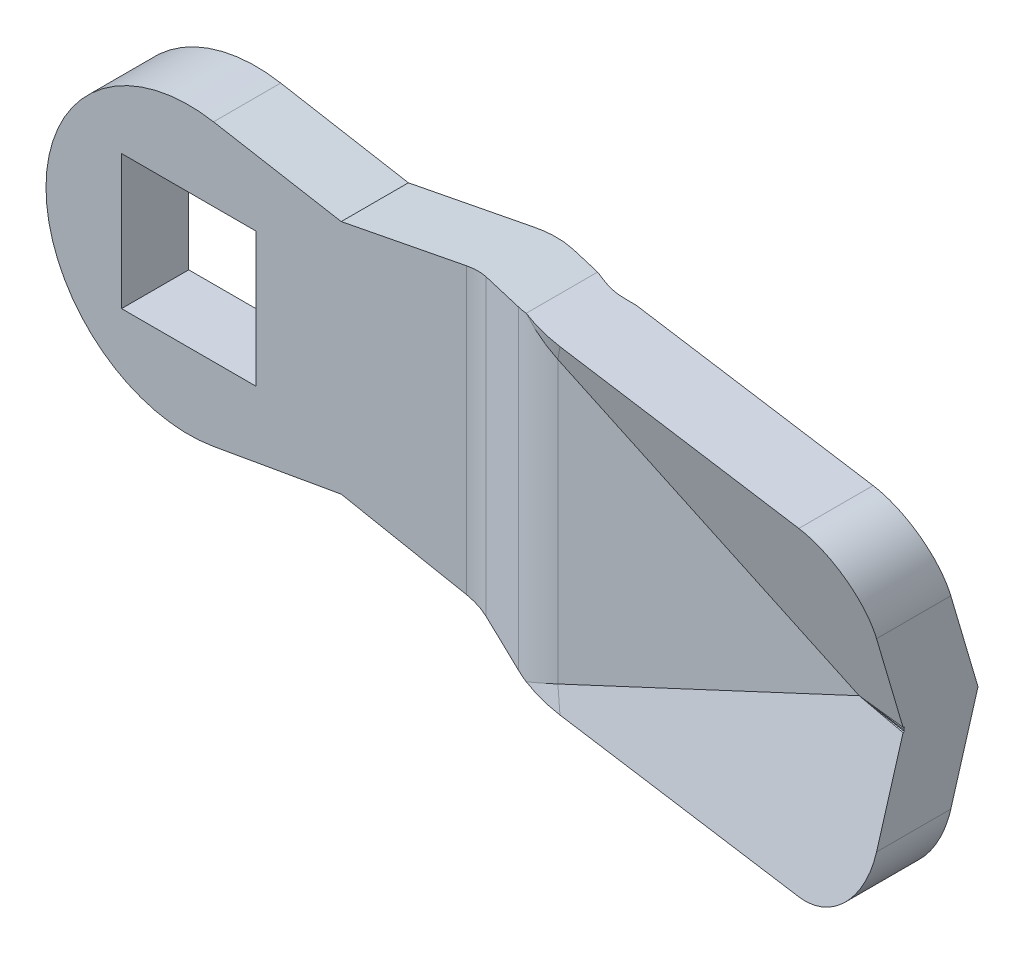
ISO-10303-21;
HEADER;
FILE_DESCRIPTION(('STEP AP214'),'2;1');
FILE_NAME('part.step','',(''),(''),'','','');
FILE_SCHEMA(('AUTOMOTIVE_DESIGN { 1 0 10303 214 1 1 1 1 }'));
ENDSEC;
DATA;
#1=APPLICATION_CONTEXT('core data for automotive mechanical design processes');
#2=APPLICATION_PROTOCOL_DEFINITION('international standard','automotive_design',2000,#1);
#3=PRODUCT_CONTEXT('',#1,'mechanical');
#4=PRODUCT('Part','Part','',(#3));
#5=PRODUCT_RELATED_PRODUCT_CATEGORY('part','',(#4));
#6=PRODUCT_DEFINITION_FORMATION('','',#4);
#7=PRODUCT_DEFINITION_CONTEXT('part definition',#1,'design');
#8=PRODUCT_DEFINITION('design','',#6,#7);
#9=PRODUCT_DEFINITION_SHAPE('','',#8);
#10=(LENGTH_UNIT() NAMED_UNIT(*) SI_UNIT(.MILLI.,.METRE.));
#11=(NAMED_UNIT(*) PLANE_ANGLE_UNIT() SI_UNIT($,.RADIAN.));
#12=(NAMED_UNIT(*) SI_UNIT($,.STERADIAN.) SOLID_ANGLE_UNIT());
#13=UNCERTAINTY_MEASURE_WITH_UNIT(LENGTH_MEASURE(1.E-05),#10,'distance_accuracy_value','');
#14=(GEOMETRIC_REPRESENTATION_CONTEXT(3) GLOBAL_UNCERTAINTY_ASSIGNED_CONTEXT((#13)) GLOBAL_UNIT_ASSIGNED_CONTEXT((#10,
#11,#12)) REPRESENTATION_CONTEXT('',''));
#15=CARTESIAN_POINT('',(0.,0.,0.));
#16=DIRECTION('',(0.,0.,1.));
#17=DIRECTION('',(1.,0.,0.));
#18=AXIS2_PLACEMENT_3D('',#15,#16,#17);
#19=CARTESIAN_POINT('',(68.0503983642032,-56.0267452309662,26.0861046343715));
#20=DIRECTION('',(0.130596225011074,-0.280064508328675,-0.951056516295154));
#21=DIRECTION('',(0.,-0.959272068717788,0.282483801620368));
#22=AXIS2_PLACEMENT_3D('',#19,#20,#21);
#23=PLANE('',#22);
#24=DIRECTION('',(-0.990703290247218,0.,-0.136040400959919));
#25=VECTOR('',#24,1.);
#26=CARTESIAN_POINT('',(69.8969690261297,-9.5,12.6386021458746));
#27=LINE('',#26,#25);
#28=CARTESIAN_POINT('',(41.,-9.5,8.6705571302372));
#29=VERTEX_POINT('',#28);
#30=CARTESIAN_POINT('',(24.5112789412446,-9.5,6.40637546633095));
#31=VERTEX_POINT('',#30);
#32=EDGE_CURVE('E494',#29,#31,#27,.T.);
#33=ORIENTED_EDGE('',*,*,#32,.F.);
#34=CARTESIAN_POINT('',(41.,-5.5,7.49264812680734));
#35=DIRECTION('',(0.130596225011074,-0.280064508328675,-0.951056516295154));
#36=DIRECTION('',(0.401933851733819,-0.861949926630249,0.309016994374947));
#37=AXIS2_PLACEMENT_3D('',#34,#35,#36);
#38=ELLIPSE('',#37,4.20584889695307,4.);
#39=CARTESIAN_POINT('',(45.,-5.5,8.0419161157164));
#40=VERTEX_POINT('',#39);
#41=EDGE_CURVE('E516',#29,#40,#38,.F.);
#42=ORIENTED_EDGE('',*,*,#41,.T.);
#43=DIRECTION('',(0.,0.959272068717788,-0.282483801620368));
#44=VECTOR('',#43,1.);
#45=CARTESIAN_POINT('',(45.,-56.884450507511,23.1734678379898));
#46=LINE('',#45,#44);
#47=CARTESIAN_POINT('',(45.,-0.136162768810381,6.46238807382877));
#48=VERTEX_POINT('',#47);
#49=EDGE_CURVE('E386',#40,#48,#46,.T.);
#50=ORIENTED_EDGE('',*,*,#49,.T.);
#51=DIRECTION('',(0.987938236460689,-0.0437421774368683,0.14854178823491));
#52=VECTOR('',#51,1.);
#53=CARTESIAN_POINT('',(72.7927650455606,-1.36672153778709,10.6411786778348));
#54=LINE('',#53,#52);
#55=CARTESIAN_POINT('',(41.924698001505,0.,6.));
#56=VERTEX_POINT('',#55);
#57=EDGE_CURVE('E231',#56,#48,#54,.T.);
#58=ORIENTED_EDGE('',*,*,#57,.F.);
#59=DIRECTION('',(0.906307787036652,0.422618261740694,0.));
#60=VECTOR('',#59,1.);
#61=CARTESIAN_POINT('',(54.0925461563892,5.67396077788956,6.));
#62=LINE('',#61,#60);
#63=CARTESIAN_POINT('',(23.9827123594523,-8.36648530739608,6.));
#64=VERTEX_POINT('',#63);
#65=EDGE_CURVE('E446',#56,#64,#62,.F.);
#66=ORIENTED_EDGE('',*,*,#65,.T.);
#67=DIRECTION('',(-0.401933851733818,0.861949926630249,-0.309016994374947));
#68=VECTOR('',#67,1.);
#69=CARTESIAN_POINT('',(50.1084127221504,-64.3932305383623,26.0861046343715));
#70=LINE('',#69,#68);
#71=EDGE_CURVE('E433',#31,#64,#70,.T.);
#72=ORIENTED_EDGE('',*,*,#71,.F.);
#73=EDGE_LOOP('',(#33,#42,#50,#58,#66,#72));
#74=FACE_BOUND('',#73,.T.);
#75=ADVANCED_FACE('F14',(#74),#23,.F.);
#76=CARTESIAN_POINT('',(45.,32.7372831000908,-36.));
#77=DIRECTION('',(-1.,0.,0.));
#78=DIRECTION('',(0.,0.,-1.));
#79=AXIS2_PLACEMENT_3D('',#76,#77,#78);
#80=PLANE('',#79);
#81=ORIENTED_EDGE('',*,*,#49,.F.);
#82=DIRECTION('',(0.,0.,-1.));
#83=VECTOR('',#82,1.);
#84=CARTESIAN_POINT('',(45.,-5.5,-36.));
#85=LINE('',#84,#83);
#86=CARTESIAN_POINT('',(45.,-5.5,3.61962487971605));
#87=VERTEX_POINT('',#86);
#88=EDGE_CURVE('E509',#40,#87,#85,.T.);
#89=ORIENTED_EDGE('',*,*,#88,.T.);
#90=DIRECTION('',(0.,-0.959272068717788,0.282483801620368));
#91=VECTOR('',#90,1.);
#92=CARTESIAN_POINT('',(45.,-65.7408100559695,21.3591730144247));
#93=LINE('',#92,#91);
#94=CARTESIAN_POINT('',(45.,0.,2.));
#95=VERTEX_POINT('',#94);
#96=EDGE_CURVE('E390',#95,#87,#93,.T.);
#97=ORIENTED_EDGE('',*,*,#96,.F.);
#98=DIRECTION('',(0.,-0.959272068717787,-0.28248380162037));
#99=VECTOR('',#98,1.);
#100=CARTESIAN_POINT('',(45.,35.0762353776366,12.3291533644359));
#101=LINE('',#100,#99);
#102=CARTESIAN_POINT('',(45.,5.5,3.61962487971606));
#103=VERTEX_POINT('',#102);
#104=EDGE_CURVE('E388',#103,#95,#101,.T.);
#105=ORIENTED_EDGE('',*,*,#104,.F.);
#106=DIRECTION('',(0.,0.,-1.));
#107=VECTOR('',#106,1.);
#108=CARTESIAN_POINT('',(45.,5.5,-36.));
#109=LINE('',#108,#107);
#110=CARTESIAN_POINT('',(45.,5.5,8.04191611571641));
#111=VERTEX_POINT('',#110);
#112=EDGE_CURVE('E507',#103,#111,#109,.F.);
#113=ORIENTED_EDGE('',*,*,#112,.T.);
#114=DIRECTION('',(0.,0.959272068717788,0.282483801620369));
#115=VECTOR('',#114,1.);
#116=CARTESIAN_POINT('',(45.,42.660667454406,18.9848873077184));
#117=LINE('',#116,#115);
#118=CARTESIAN_POINT('',(45.,0.136162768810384,6.46238807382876));
#119=VERTEX_POINT('',#118);
#120=EDGE_CURVE('E384',#119,#111,#117,.T.);
#121=ORIENTED_EDGE('',*,*,#120,.F.);
#122=DIRECTION('',(0.,-0.282483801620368,-0.959272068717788));
#123=VECTOR('',#122,1.);
#124=CARTESIAN_POINT('',(45.,-8.76877027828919,-23.7774115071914));
#125=LINE('',#124,#123);
#126=CARTESIAN_POINT('',(45.,0.114431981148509,6.38859362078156));
#127=VERTEX_POINT('',#126);
#128=EDGE_CURVE('E503',#119,#127,#125,.T.);
#129=ORIENTED_EDGE('',*,*,#128,.T.);
#130=CARTESIAN_POINT('',(45.,0.,6.42229123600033));
#131=VERTEX_POINT('',#130);
#132=EDGE_CURVE('E246',#131,#127,#46,.T.);
#133=ORIENTED_EDGE('',*,*,#132,.F.);
#134=DIRECTION('',(0.,-0.959272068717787,-0.28248380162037));
#135=VECTOR('',#134,1.);
#136=CARTESIAN_POINT('',(45.,18.629400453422,11.9082258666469));
#137=LINE('',#136,#135);
#138=CARTESIAN_POINT('',(45.,-0.114431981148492,6.38859362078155));
#139=VERTEX_POINT('',#138);
#140=EDGE_CURVE('E239',#131,#139,#137,.T.);
#141=ORIENTED_EDGE('',*,*,#140,.T.);
#142=DIRECTION('',(0.,0.28248380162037,-0.959272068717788));
#143=VECTOR('',#142,1.);
#144=CARTESIAN_POINT('',(45.,13.9934506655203,-41.5196322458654));
#145=LINE('',#144,#143);
#146=EDGE_CURVE('E225',#48,#139,#145,.T.);
#147=ORIENTED_EDGE('',*,*,#146,.F.);
#148=EDGE_LOOP('',(#81,#89,#97,#105,#113,#121,#129,#133,#141,#147));
#149=FACE_BOUND('',#148,.T.);
#150=ADVANCED_FACE('F244',(#149),#80,.F.);
#151=CARTESIAN_POINT('',(10.5,-2.8,-2.4));
#152=DIRECTION('',(1.,0.,0.));
#153=DIRECTION('',(0.,0.,1.));
#154=AXIS2_PLACEMENT_3D('',#151,#152,#153);
#155=PLANE('',#154);
#156=DIRECTION('',(0.,0.,1.));
#157=VECTOR('',#156,1.);
#158=CARTESIAN_POINT('',(10.5,-2.8,-2.4));
#159=LINE('',#158,#157);
#160=CARTESIAN_POINT('',(10.5,-2.8,-0.4));
#161=VERTEX_POINT('',#160);
#162=CARTESIAN_POINT('',(10.5,-2.8,0.));
#163=VERTEX_POINT('',#162);
#164=EDGE_CURVE('E291',#161,#163,#159,.T.);
#165=ORIENTED_EDGE('',*,*,#164,.F.);
#166=DIRECTION('',(0.,-1.,0.));
#167=VECTOR('',#166,1.);
#168=CARTESIAN_POINT('',(10.5,9.5,-0.4));
#169=LINE('',#168,#167);
#170=CARTESIAN_POINT('',(10.5,2.8,-0.4));
#171=VERTEX_POINT('',#170);
#172=EDGE_CURVE('E257',#171,#161,#169,.T.);
#173=ORIENTED_EDGE('',*,*,#172,.F.);
#174=DIRECTION('',(0.,0.,1.));
#175=VECTOR('',#174,1.);
#176=CARTESIAN_POINT('',(10.5,2.8,-2.4));
#177=LINE('',#176,#175);
#178=CARTESIAN_POINT('',(10.5,2.8,0.));
#179=VERTEX_POINT('',#178);
#180=EDGE_CURVE('E283',#171,#179,#177,.T.);
#181=ORIENTED_EDGE('',*,*,#180,.T.);
#182=DIRECTION('',(0.,1.,0.));
#183=VECTOR('',#182,1.);
#184=CARTESIAN_POINT('',(10.5,-2.8,0.));
#185=LINE('',#184,#183);
#186=EDGE_CURVE('E264',#163,#179,#185,.T.);
#187=ORIENTED_EDGE('',*,*,#186,.F.);
#188=EDGE_LOOP('',(#165,#173,#181,#187));
#189=FACE_BOUND('',#188,.T.);
#190=ADVANCED_FACE('F621',(#189),#155,.T.);
#191=CARTESIAN_POINT('',(10.5,-2.8,-2.4));
#192=DIRECTION('',(0.,1.,0.));
#193=DIRECTION('',(1.,0.,0.));
#194=AXIS2_PLACEMENT_3D('',#191,#192,#193);
#195=PLANE('',#194);
#196=DIRECTION('',(0.707106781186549,0.,0.707106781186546));
#197=VECTOR('',#196,1.);
#198=CARTESIAN_POINT('',(8.5,-2.8,-2.4));
#199=LINE('',#198,#197);
#200=CARTESIAN_POINT('',(8.5,-2.8,-2.4));
#201=VERTEX_POINT('',#200);
#202=EDGE_CURVE('E254',#201,#161,#199,.T.);
#203=ORIENTED_EDGE('',*,*,#202,.T.);
#204=ORIENTED_EDGE('',*,*,#164,.T.);
#205=DIRECTION('',(-1.,0.,0.));
#206=VECTOR('',#205,1.);
#207=CARTESIAN_POINT('',(10.5,-2.8,0.));
#208=LINE('',#207,#206);
#209=CARTESIAN_POINT('',(6.5,-2.8,0.));
#210=VERTEX_POINT('',#209);
#211=EDGE_CURVE('E272',#163,#210,#208,.T.);
#212=ORIENTED_EDGE('',*,*,#211,.T.);
#213=DIRECTION('',(0.,0.,1.));
#214=VECTOR('',#213,1.);
#215=CARTESIAN_POINT('',(6.5,-2.8,-2.4));
#216=LINE('',#215,#214);
#217=CARTESIAN_POINT('',(6.5,-2.8,-2.4));
#218=VERTEX_POINT('',#217);
#219=EDGE_CURVE('E288',#218,#210,#216,.T.);
#220=ORIENTED_EDGE('',*,*,#219,.F.);
#221=DIRECTION('',(-1.,0.,0.));
#222=VECTOR('',#221,1.);
#223=CARTESIAN_POINT('',(10.5,-2.8,-2.4));
#224=LINE('',#223,#222);
#225=EDGE_CURVE('E281',#201,#218,#224,.T.);
#226=ORIENTED_EDGE('',*,*,#225,.F.);
#227=EDGE_LOOP('',(#203,#204,#212,#220,#226));
#228=FACE_BOUND('',#227,.T.);
#229=ADVANCED_FACE('F654',(#228),#195,.F.);
#230=CARTESIAN_POINT('',(6.5,2.8,-2.4));
#231=DIRECTION('',(0.,-1.,0.));
#232=DIRECTION('',(-1.,0.,0.));
#233=AXIS2_PLACEMENT_3D('',#230,#231,#232);
#234=PLANE('',#233);
#235=DIRECTION('',(0.707106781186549,0.,0.707106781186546));
#236=VECTOR('',#235,1.);
#237=CARTESIAN_POINT('',(7.5,2.8,-3.4));
#238=LINE('',#237,#236);
#239=CARTESIAN_POINT('',(8.5,2.8,-2.4));
#240=VERTEX_POINT('',#239);
#241=EDGE_CURVE('E262',#240,#171,#238,.T.);
#242=ORIENTED_EDGE('',*,*,#241,.F.);
#243=DIRECTION('',(1.,0.,0.));
#244=VECTOR('',#243,1.);
#245=CARTESIAN_POINT('',(6.5,2.8,-2.4));
#246=LINE('',#245,#244);
#247=CARTESIAN_POINT('',(6.5,2.8,-2.4));
#248=VERTEX_POINT('',#247);
#249=EDGE_CURVE('E275',#248,#240,#246,.T.);
#250=ORIENTED_EDGE('',*,*,#249,.F.);
#251=DIRECTION('',(0.,0.,1.));
#252=VECTOR('',#251,1.);
#253=CARTESIAN_POINT('',(6.5,2.8,-2.4));
#254=LINE('',#253,#252);
#255=CARTESIAN_POINT('',(6.5,2.8,0.));
#256=VERTEX_POINT('',#255);
#257=EDGE_CURVE('E285',#248,#256,#254,.T.);
#258=ORIENTED_EDGE('',*,*,#257,.T.);
#259=DIRECTION('',(1.,0.,0.));
#260=VECTOR('',#259,1.);
#261=CARTESIAN_POINT('',(6.5,2.8,0.));
#262=LINE('',#261,#260);
#263=EDGE_CURVE('E267',#256,#179,#262,.T.);
#264=ORIENTED_EDGE('',*,*,#263,.T.);
#265=ORIENTED_EDGE('',*,*,#180,.F.);
#266=EDGE_LOOP('',(#242,#250,#258,#264,#265));
#267=FACE_BOUND('',#266,.T.);
#268=ADVANCED_FACE('F650',(#267),#234,.F.);
#269=CARTESIAN_POINT('',(10.5,2.8,-2.4));
#270=DIRECTION('',(0.,0.,-1.));
#271=DIRECTION('',(0.,-1.,0.));
#272=AXIS2_PLACEMENT_3D('',#269,#270,#271);
#273=PLANE('',#272);
#274=ORIENTED_EDGE('',*,*,#249,.T.);
#275=DIRECTION('',(0.,-1.,0.));
#276=VECTOR('',#275,1.);
#277=CARTESIAN_POINT('',(8.5,9.5,-2.4));
#278=LINE('',#277,#276);
#279=EDGE_CURVE('E259',#240,#201,#278,.T.);
#280=ORIENTED_EDGE('',*,*,#279,.T.);
#281=ORIENTED_EDGE('',*,*,#225,.T.);
#282=DIRECTION('',(0.,-1.,0.));
#283=VECTOR('',#282,1.);
#284=CARTESIAN_POINT('',(6.5,2.8,-2.4));
#285=LINE('',#284,#283);
#286=EDGE_CURVE('E278',#248,#218,#285,.T.);
#287=ORIENTED_EDGE('',*,*,#286,.F.);
#288=EDGE_LOOP('',(#274,#280,#281,#287));
#289=FACE_BOUND('',#288,.T.);
#290=ADVANCED_FACE('F647',(#289),#273,.T.);
#291=CARTESIAN_POINT('',(16.5484656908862,-9.5,0.));
#292=DIRECTION('',(0.,0.,-1.));
#293=DIRECTION('',(1.,0.,0.));
#294=AXIS2_PLACEMENT_3D('',#291,#292,#293);
#295=PLANE('',#294);
#296=DIRECTION('',(0.98480775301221,-0.173648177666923,0.));
#297=VECTOR('',#296,1.);
#298=CARTESIAN_POINT('',(19.1500735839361,5.25445154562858,0.));
#299=LINE('',#298,#297);
#300=CARTESIAN_POINT('',(1.47600951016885,8.37086590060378,0.));
#301=VERTEX_POINT('',#300);
#302=CARTESIAN_POINT('',(9.08064803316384,7.02996295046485,0.));
#303=VERTEX_POINT('',#302);
#304=EDGE_CURVE('E500',#301,#303,#299,.T.);
#305=ORIENTED_EDGE('',*,*,#304,.T.);
#306=DIRECTION('',(0.981627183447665,0.190808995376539,0.));
#307=VECTOR('',#306,1.);
#308=CARTESIAN_POINT('',(13.1804602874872,7.8268857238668,0.));
#309=LINE('',#308,#307);
#310=CARTESIAN_POINT('',(16.5484656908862,8.48155965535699,0.));
#311=VERTEX_POINT('',#310);
#312=EDGE_CURVE('E315',#303,#311,#309,.T.);
#313=ORIENTED_EDGE('',*,*,#312,.T.);
#314=DIRECTION('',(0.,1.,0.));
#315=VECTOR('',#314,1.);
#316=CARTESIAN_POINT('',(16.5484656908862,-9.5,0.));
#317=LINE('',#316,#315);
#318=CARTESIAN_POINT('',(16.5484656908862,-8.481559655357,0.));
#319=VERTEX_POINT('',#318);
#320=EDGE_CURVE('E479',#319,#311,#317,.T.);
#321=ORIENTED_EDGE('',*,*,#320,.F.);
#322=DIRECTION('',(0.981627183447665,-0.190808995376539,0.));
#323=VECTOR('',#322,1.);
#324=CARTESIAN_POINT('',(16.7392229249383,-8.51863910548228,0.));
#325=LINE('',#324,#323);
#326=CARTESIAN_POINT('',(9.08064803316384,-7.02996295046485,0.));
#327=VERTEX_POINT('',#326);
#328=EDGE_CURVE('E330',#327,#319,#325,.T.);
#329=ORIENTED_EDGE('',*,*,#328,.F.);
#330=DIRECTION('',(0.98480775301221,0.173648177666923,0.));
#331=VECTOR('',#330,1.);
#332=CARTESIAN_POINT('',(15.9008822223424,-5.8273716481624,0.));
#333=LINE('',#332,#331);
#334=CARTESIAN_POINT('',(1.47600951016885,-8.37086590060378,0.));
#335=VERTEX_POINT('',#334);
#336=EDGE_CURVE('E498',#335,#327,#333,.T.);
#337=ORIENTED_EDGE('',*,*,#336,.F.);
#338=CARTESIAN_POINT('',(0.,0.,0.));
#339=DIRECTION('',(0.,0.,-1.));
#340=DIRECTION('',(1.,0.,0.));
#341=AXIS2_PLACEMENT_3D('',#338,#339,#340);
#342=CIRCLE('',#341,8.5);
#343=EDGE_CURVE('E343',#335,#301,#342,.T.);
#344=ORIENTED_EDGE('',*,*,#343,.T.);
#345=EDGE_LOOP('',(#305,#313,#321,#329,#337,#344));
#346=FACE_BOUND('',#345,.T.);
#347=DIRECTION('',(1.,0.,0.));
#348=VECTOR('',#347,1.);
#349=CARTESIAN_POINT('',(-4.,-4.,0.));
#350=LINE('',#349,#348);
#351=CARTESIAN_POINT('',(-4.,-4.,0.));
#352=VERTEX_POINT('',#351);
#353=CARTESIAN_POINT('',(4.,-4.,0.));
#354=VERTEX_POINT('',#353);
#355=EDGE_CURVE('E367',#352,#354,#350,.T.);
#356=ORIENTED_EDGE('',*,*,#355,.T.);
#357=DIRECTION('',(0.,-1.,0.));
#358=VECTOR('',#357,1.);
#359=CARTESIAN_POINT('',(4.,4.,0.));
#360=LINE('',#359,#358);
#361=CARTESIAN_POINT('',(4.,4.,0.));
#362=VERTEX_POINT('',#361);
#363=EDGE_CURVE('E364',#362,#354,#360,.T.);
#364=ORIENTED_EDGE('',*,*,#363,.F.);
#365=DIRECTION('',(-1.,0.,0.));
#366=VECTOR('',#365,1.);
#367=CARTESIAN_POINT('',(4.,4.,0.));
#368=LINE('',#367,#366);
#369=CARTESIAN_POINT('',(-4.,4.,0.));
#370=VERTEX_POINT('',#369);
#371=EDGE_CURVE('E372',#362,#370,#368,.T.);
#372=ORIENTED_EDGE('',*,*,#371,.T.);
#373=DIRECTION('',(0.,1.,0.));
#374=VECTOR('',#373,1.);
#375=CARTESIAN_POINT('',(-4.,-4.,0.));
#376=LINE('',#375,#374);
#377=EDGE_CURVE('E370',#352,#370,#376,.T.);
#378=ORIENTED_EDGE('',*,*,#377,.F.);
#379=EDGE_LOOP('',(#356,#364,#372,#378));
#380=FACE_BOUND('',#379,.T.);
#381=ORIENTED_EDGE('',*,*,#211,.F.);
#382=ORIENTED_EDGE('',*,*,#186,.T.);
#383=ORIENTED_EDGE('',*,*,#263,.F.);
#384=DIRECTION('',(0.,-1.,0.));
#385=VECTOR('',#384,1.);
#386=CARTESIAN_POINT('',(6.5,2.8,0.));
#387=LINE('',#386,#385);
#388=EDGE_CURVE('E270',#256,#210,#387,.T.);
#389=ORIENTED_EDGE('',*,*,#388,.T.);
#390=EDGE_LOOP('',(#381,#382,#383,#389));
#391=FACE_BOUND('',#390,.T.);
#392=ADVANCED_FACE('F581',(#346,#380,#391),#295,.T.);
#393=CARTESIAN_POINT('',(16.5484656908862,-9.5,4.));
#394=DIRECTION('',(0.,0.,-1.));
#395=DIRECTION('',(1.,0.,0.));
#396=AXIS2_PLACEMENT_3D('',#393,#394,#395);
#397=PLANE('',#396);
#398=DIRECTION('',(0.,-1.,0.));
#399=VECTOR('',#398,1.);
#400=CARTESIAN_POINT('',(4.,4.,4.));
#401=LINE('',#400,#399);
#402=CARTESIAN_POINT('',(4.,4.,4.));
#403=VERTEX_POINT('',#402);
#404=CARTESIAN_POINT('',(4.,-4.,4.));
#405=VERTEX_POINT('',#404);
#406=EDGE_CURVE('E352',#403,#405,#401,.T.);
#407=ORIENTED_EDGE('',*,*,#406,.T.);
#408=DIRECTION('',(1.,0.,0.));
#409=VECTOR('',#408,1.);
#410=CARTESIAN_POINT('',(-4.,-4.,4.));
#411=LINE('',#410,#409);
#412=CARTESIAN_POINT('',(-4.,-4.,4.));
#413=VERTEX_POINT('',#412);
#414=EDGE_CURVE('E355',#413,#405,#411,.T.);
#415=ORIENTED_EDGE('',*,*,#414,.F.);
#416=DIRECTION('',(0.,1.,0.));
#417=VECTOR('',#416,1.);
#418=CARTESIAN_POINT('',(-4.,-4.,4.));
#419=LINE('',#418,#417);
#420=CARTESIAN_POINT('',(-4.,4.,4.));
#421=VERTEX_POINT('',#420);
#422=EDGE_CURVE('E358',#413,#421,#419,.T.);
#423=ORIENTED_EDGE('',*,*,#422,.T.);
#424=DIRECTION('',(-1.,0.,0.));
#425=VECTOR('',#424,1.);
#426=CARTESIAN_POINT('',(4.,4.,4.));
#427=LINE('',#426,#425);
#428=EDGE_CURVE('E361',#403,#421,#427,.T.);
#429=ORIENTED_EDGE('',*,*,#428,.F.);
#430=EDGE_LOOP('',(#407,#415,#423,#429));
#431=FACE_BOUND('',#430,.T.);
#432=DIRECTION('',(0.981627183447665,0.190808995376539,0.));
#433=VECTOR('',#432,1.);
#434=CARTESIAN_POINT('',(13.1804602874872,7.8268857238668,4.));
#435=LINE('',#434,#433);
#436=CARTESIAN_POINT('',(9.08064803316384,7.02996295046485,4.));
#437=VERTEX_POINT('',#436);
#438=CARTESIAN_POINT('',(16.5484656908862,8.481559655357,4.));
#439=VERTEX_POINT('',#438);
#440=EDGE_CURVE('E325',#437,#439,#435,.T.);
#441=ORIENTED_EDGE('',*,*,#440,.F.);
#442=DIRECTION('',(0.98480775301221,-0.173648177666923,0.));
#443=VECTOR('',#442,1.);
#444=CARTESIAN_POINT('',(19.1500735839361,5.25445154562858,4.));
#445=LINE('',#444,#443);
#446=CARTESIAN_POINT('',(1.47600951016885,8.37086590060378,4.));
#447=VERTEX_POINT('',#446);
#448=EDGE_CURVE('E350',#447,#437,#445,.T.);
#449=ORIENTED_EDGE('',*,*,#448,.F.);
#450=CARTESIAN_POINT('',(0.,0.,4.));
#451=DIRECTION('',(0.,0.,-1.));
#452=DIRECTION('',(1.,0.,0.));
#453=AXIS2_PLACEMENT_3D('',#450,#451,#452);
#454=CIRCLE('',#453,8.5);
#455=CARTESIAN_POINT('',(1.47600951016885,-8.37086590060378,4.));
#456=VERTEX_POINT('',#455);
#457=EDGE_CURVE('E345',#456,#447,#454,.T.);
#458=ORIENTED_EDGE('',*,*,#457,.F.);
#459=DIRECTION('',(0.98480775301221,0.173648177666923,0.));
#460=VECTOR('',#459,1.);
#461=CARTESIAN_POINT('',(15.9008822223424,-5.8273716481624,4.));
#462=LINE('',#461,#460);
#463=CARTESIAN_POINT('',(9.08064803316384,-7.02996295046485,4.));
#464=VERTEX_POINT('',#463);
#465=EDGE_CURVE('E347',#456,#464,#462,.T.);
#466=ORIENTED_EDGE('',*,*,#465,.T.);
#467=DIRECTION('',(0.981627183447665,-0.190808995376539,0.));
#468=VECTOR('',#467,1.);
#469=CARTESIAN_POINT('',(16.7392229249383,-8.51863910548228,4.));
#470=LINE('',#469,#468);
#471=CARTESIAN_POINT('',(16.5484656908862,-8.481559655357,4.));
#472=VERTEX_POINT('',#471);
#473=EDGE_CURVE('E340',#464,#472,#470,.T.);
#474=ORIENTED_EDGE('',*,*,#473,.T.);
#475=DIRECTION('',(0.,1.,0.));
#476=VECTOR('',#475,1.);
#477=CARTESIAN_POINT('',(16.5484656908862,-9.5,4.));
#478=LINE('',#477,#476);
#479=EDGE_CURVE('E482',#472,#439,#478,.T.);
#480=ORIENTED_EDGE('',*,*,#479,.T.);
#481=EDGE_LOOP('',(#441,#449,#458,#466,#474,#480));
#482=FACE_BOUND('',#481,.T.);
#483=ADVANCED_FACE('F593',(#431,#482),#397,.F.);
#484=CARTESIAN_POINT('',(23.9827123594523,-9.5,-2.));
#485=DIRECTION('',(0.,1.,0.));
#486=DIRECTION('',(1.,0.,0.));
#487=AXIS2_PLACEMENT_3D('',#484,#485,#486);
#488=CYLINDRICAL_SURFACE('',#487,8.);
#489=CARTESIAN_POINT('',(23.9827123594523,9.92663082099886,-2.));
#490=DIRECTION('',(-0.190808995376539,0.981627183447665,0.));
#491=DIRECTION('',(0.981627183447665,0.190808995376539,0.));
#492=AXIS2_PLACEMENT_3D('',#489,#490,#491);
#493=ELLIPSE('',#492,8.1497335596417,8.);
#494=CARTESIAN_POINT('',(21.1157687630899,9.36935343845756,5.46864341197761));
#495=VERTEX_POINT('',#494);
#496=CARTESIAN_POINT('',(21.7878870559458,9.5,5.69303203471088));
#497=VERTEX_POINT('',#496);
#498=EDGE_CURVE('E323',#495,#497,#493,.T.);
#499=ORIENTED_EDGE('',*,*,#498,.F.);
#500=DIRECTION('',(0.,1.,0.));
#501=VECTOR('',#500,1.);
#502=CARTESIAN_POINT('',(21.1157687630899,-9.5,5.46864341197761));
#503=LINE('',#502,#501);
#504=CARTESIAN_POINT('',(21.1157687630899,-9.36935343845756,5.46864341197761));
#505=VERTEX_POINT('',#504);
#506=EDGE_CURVE('E488',#505,#495,#503,.T.);
#507=ORIENTED_EDGE('',*,*,#506,.F.);
#508=CARTESIAN_POINT('',(23.9827123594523,-9.92663082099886,-2.));
#509=DIRECTION('',(0.190808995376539,0.981627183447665,0.));
#510=DIRECTION('',(-0.981627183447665,0.190808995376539,0.));
#511=AXIS2_PLACEMENT_3D('',#508,#509,#510);
#512=ELLIPSE('',#511,8.1497335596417,8.);
#513=CARTESIAN_POINT('',(21.7878870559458,-9.5,5.69303203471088));
#514=VERTEX_POINT('',#513);
#515=EDGE_CURVE('E337',#505,#514,#512,.T.);
#516=ORIENTED_EDGE('',*,*,#515,.T.);
#517=CARTESIAN_POINT('',(23.9827123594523,-11.2345590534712,-2.));
#518=DIRECTION('',(-0.401933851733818,0.861949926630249,-0.309016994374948));
#519=DIRECTION('',(0.683336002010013,0.506993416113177,0.52536614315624));
#520=AXIS2_PLACEMENT_3D('',#517,#518,#519);
#521=ELLIPSE('',#520,9.28128160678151,8.);
#522=EDGE_CURVE('E452',#64,#514,#521,.F.);
#523=ORIENTED_EDGE('',*,*,#522,.F.);
#524=DIRECTION('',(0.,1.,0.));
#525=VECTOR('',#524,1.);
#526=CARTESIAN_POINT('',(23.9827123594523,-9.5,6.));
#527=LINE('',#526,#525);
#528=CARTESIAN_POINT('',(23.9827123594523,8.36648530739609,6.));
#529=VERTEX_POINT('',#528);
#530=EDGE_CURVE('E491',#64,#529,#527,.T.);
#531=ORIENTED_EDGE('',*,*,#530,.T.);
#532=CARTESIAN_POINT('',(23.9827123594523,11.2345590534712,-2.));
#533=DIRECTION('',(-0.401933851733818,-0.861949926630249,-0.309016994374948));
#534=DIRECTION('',(-0.683336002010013,0.506993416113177,-0.52536614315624));
#535=AXIS2_PLACEMENT_3D('',#532,#533,#534);
#536=ELLIPSE('',#535,9.28128160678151,8.);
#537=EDGE_CURVE('E449',#529,#497,#536,.T.);
#538=ORIENTED_EDGE('',*,*,#537,.T.);
#539=EDGE_LOOP('',(#499,#507,#516,#523,#531,#538));
#540=FACE_BOUND('',#539,.T.);
#541=ADVANCED_FACE('F541',(#540),#488,.T.);
#542=CARTESIAN_POINT('',(23.9827123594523,-9.5,-2.));
#543=DIRECTION('',(0.,-1.,0.));
#544=DIRECTION('',(-1.,0.,0.));
#545=AXIS2_PLACEMENT_3D('',#542,#543,#544);
#546=PLANE('',#545);
#547=DIRECTION('',(0.990703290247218,0.,0.136040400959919));
#548=VECTOR('',#547,1.);
#549=CARTESIAN_POINT('',(52.9764947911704,-9.5,5.89284219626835));
#550=LINE('',#549,#548);
#551=CARTESIAN_POINT('',(24.6271842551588,-9.5,2.));
#552=VERTEX_POINT('',#551);
#553=CARTESIAN_POINT('',(41.,-9.5,4.24826589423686));
#554=VERTEX_POINT('',#553);
#555=EDGE_CURVE('E393',#552,#554,#550,.T.);
#556=ORIENTED_EDGE('',*,*,#555,.T.);
#557=DIRECTION('',(0.,0.,-1.));
#558=VECTOR('',#557,1.);
#559=CARTESIAN_POINT('',(41.,-9.5,-36.));
#560=LINE('',#559,#558);
#561=EDGE_CURVE('E514',#554,#29,#560,.F.);
#562=ORIENTED_EDGE('',*,*,#561,.T.);
#563=ORIENTED_EDGE('',*,*,#32,.T.);
#564=CARTESIAN_POINT('',(21.7878870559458,-9.5,5.69303203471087));
#565=CARTESIAN_POINT('',(21.8978533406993,-9.50000000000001,5.73554810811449));
#566=CARTESIAN_POINT('',(22.0083908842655,-9.50000000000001,5.77659145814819));
#567=CARTESIAN_POINT('',(22.2302747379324,-9.50000000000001,5.85555110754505));
#568=CARTESIAN_POINT('',(22.3416184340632,-9.50000000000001,5.89347475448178));
#569=CARTESIAN_POINT('',(22.5651271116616,-9.50000000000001,5.96615939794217));
#570=CARTESIAN_POINT('',(22.6772903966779,-9.50000000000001,6.00092560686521));
#571=CARTESIAN_POINT('',(22.9024539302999,-9.50000000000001,6.06724644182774));
#572=CARTESIAN_POINT('',(23.0154533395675,-9.50000000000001,6.09880391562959));
#573=CARTESIAN_POINT('',(23.242332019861,-9.50000000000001,6.15865159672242));
#574=CARTESIAN_POINT('',(23.3562114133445,-9.50000000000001,6.1869413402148));
#575=CARTESIAN_POINT('',(23.5848457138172,-9.50000000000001,6.24016838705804));
#576=CARTESIAN_POINT('',(23.6996012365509,-9.50000000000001,6.26510304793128));
#577=CARTESIAN_POINT('',(23.9300074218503,-9.50000000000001,6.31152637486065));
#578=CARTESIAN_POINT('',(24.045659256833,-9.50000000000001,6.3330092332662));
#579=CARTESIAN_POINT('',(24.2778791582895,-9.50000000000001,6.37241674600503));
#580=CARTESIAN_POINT('',(24.3944488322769,-9.50000000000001,6.39033192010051));
#581=CARTESIAN_POINT('',(24.5112789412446,-9.5,6.40637546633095));
#582=B_SPLINE_CURVE_WITH_KNOTS('',3,(#564,#565,#566,#567,#568,#569,#570,#571,#572,#573,#574,
#575,#576,#577,#578,#579,#580,#581),.UNSPECIFIED.,.F.,.F.,(4,2,2,2,2,2,2,2,4),(0.,
0.353689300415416,0.7065201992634,1.05875762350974,1.41067965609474,1.76265157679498,
2.11489910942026,2.46773322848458,2.82149276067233),.UNSPECIFIED.);
#583=EDGE_CURVE('E396',#514,#31,#582,.T.);
#584=ORIENTED_EDGE('',*,*,#583,.F.);
#585=DIRECTION('',(0.,0.,1.));
#586=VECTOR('',#585,1.);
#587=CARTESIAN_POINT('',(21.7878870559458,-9.5,-21.));
#588=LINE('',#587,#586);
#589=CARTESIAN_POINT('',(21.7878870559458,-9.5,1.44206547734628));
#590=VERTEX_POINT('',#589);
#591=EDGE_CURVE('E293',#590,#514,#588,.T.);
#592=ORIENTED_EDGE('',*,*,#591,.F.);
#593=DIRECTION('',(-0.933580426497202,0.,-0.358367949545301));
#594=VECTOR('',#593,1.);
#595=CARTESIAN_POINT('',(22.5492405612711,-9.5,1.73432170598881));
#596=LINE('',#595,#594);
#597=CARTESIAN_POINT('',(22.5492405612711,-9.5,1.73432170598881));
#598=VERTEX_POINT('',#597);
#599=EDGE_CURVE('E463',#598,#590,#596,.T.);
#600=ORIENTED_EDGE('',*,*,#599,.F.);
#601=CARTESIAN_POINT('',(23.9827123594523,-9.5,-2.));
#602=DIRECTION('',(0.,-1.,0.));
#603=DIRECTION('',(-1.,0.,0.));
#604=AXIS2_PLACEMENT_3D('',#601,#602,#603);
#605=CIRCLE('',#604,4.);
#606=CARTESIAN_POINT('',(23.9827123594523,-9.5,2.));
#607=VERTEX_POINT('',#606);
#608=EDGE_CURVE('E466',#607,#598,#605,.T.);
#609=ORIENTED_EDGE('',*,*,#608,.F.);
#610=DIRECTION('',(-1.,0.,0.));
#611=VECTOR('',#610,1.);
#612=CARTESIAN_POINT('',(45.,-9.5,2.));
#613=LINE('',#612,#611);
#614=EDGE_CURVE('E469',#552,#607,#613,.T.);
#615=ORIENTED_EDGE('',*,*,#614,.F.);
#616=EDGE_LOOP('',(#556,#562,#563,#584,#592,#600,#609,#615));
#617=FACE_BOUND('',#616,.T.);
#618=ADVANCED_FACE('F558',(#617),#546,.T.);
#619=CARTESIAN_POINT('',(21.1157687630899,-9.5,5.46864341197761));
#620=DIRECTION('',(0.358367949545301,0.,-0.933580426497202));
#621=DIRECTION('',(0.933580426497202,0.,0.358367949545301));
#622=AXIS2_PLACEMENT_3D('',#619,#620,#621);
#623=PLANE('',#622);
#624=DIRECTION('',(0.918577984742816,0.178553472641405,0.352609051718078));
#625=VECTOR('',#624,1.);
#626=CARTESIAN_POINT('',(18.0209063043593,8.7677731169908,4.28063702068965));
#627=LINE('',#626,#625);
#628=CARTESIAN_POINT('',(17.9819374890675,8.76019834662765,4.26567829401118));
#629=VERTEX_POINT('',#628);
#630=EDGE_CURVE('E321',#629,#495,#627,.T.);
#631=ORIENTED_EDGE('',*,*,#630,.F.);
#632=DIRECTION('',(0.,1.,0.));
#633=VECTOR('',#632,1.);
#634=CARTESIAN_POINT('',(17.9819374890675,-9.5,4.26567829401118));
#635=LINE('',#634,#633);
#636=CARTESIAN_POINT('',(17.9819374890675,-8.76019834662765,4.26567829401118));
#637=VERTEX_POINT('',#636);
#638=EDGE_CURVE('E485',#637,#629,#635,.T.);
#639=ORIENTED_EDGE('',*,*,#638,.F.);
#640=DIRECTION('',(0.918577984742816,-0.178553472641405,0.352609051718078));
#641=VECTOR('',#640,1.);
#642=CARTESIAN_POINT('',(21.137196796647,-9.3735186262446,5.47686886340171));
#643=LINE('',#642,#641);
#644=EDGE_CURVE('E334',#637,#505,#643,.T.);
#645=ORIENTED_EDGE('',*,*,#644,.T.);
#646=ORIENTED_EDGE('',*,*,#506,.T.);
#647=EDGE_LOOP('',(#631,#639,#645,#646));
#648=FACE_BOUND('',#647,.T.);
#649=ADVANCED_FACE('F601',(#648),#623,.F.);
#650=CARTESIAN_POINT('',(16.5484656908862,-9.5,8.));
#651=DIRECTION('',(0.,1.,0.));
#652=DIRECTION('',(1.,0.,0.));
#653=AXIS2_PLACEMENT_3D('',#650,#651,#652);
#654=CYLINDRICAL_SURFACE('',#653,4.);
#655=ORIENTED_EDGE('',*,*,#638,.T.);
#656=CARTESIAN_POINT('',(16.5484656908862,8.481559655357,8.));
#657=DIRECTION('',(-0.190808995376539,0.981627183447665,0.));
#658=DIRECTION('',(0.981627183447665,0.190808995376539,0.));
#659=AXIS2_PLACEMENT_3D('',#656,#657,#658);
#660=ELLIPSE('',#659,4.07486677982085,4.);
#661=EDGE_CURVE('E318',#629,#439,#660,.T.);
#662=ORIENTED_EDGE('',*,*,#661,.T.);
#663=ORIENTED_EDGE('',*,*,#479,.F.);
#664=CARTESIAN_POINT('',(16.5484656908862,-8.481559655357,8.));
#665=DIRECTION('',(0.190808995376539,0.981627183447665,0.));
#666=DIRECTION('',(-0.981627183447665,0.190808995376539,0.));
#667=AXIS2_PLACEMENT_3D('',#664,#665,#666);
#668=ELLIPSE('',#667,4.07486677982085,4.);
#669=EDGE_CURVE('E332',#637,#472,#668,.T.);
#670=ORIENTED_EDGE('',*,*,#669,.F.);
#671=EDGE_LOOP('',(#655,#662,#663,#670));
#672=FACE_BOUND('',#671,.T.);
#673=ADVANCED_FACE('F597',(#672),#654,.F.);
#674=CARTESIAN_POINT('',(16.5484656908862,-9.5,8.));
#675=DIRECTION('',(0.,1.,0.));
#676=DIRECTION('',(1.,0.,0.));
#677=AXIS2_PLACEMENT_3D('',#674,#675,#676);
#678=CYLINDRICAL_SURFACE('',#677,8.);
#679=CARTESIAN_POINT('',(16.5484656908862,8.481559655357,8.));
#680=DIRECTION('',(-0.190808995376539,0.981627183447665,0.));
#681=DIRECTION('',(0.981627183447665,0.190808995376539,0.));
#682=AXIS2_PLACEMENT_3D('',#679,#680,#681);
#683=ELLIPSE('',#682,8.1497335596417,8.);
#684=CARTESIAN_POINT('',(19.4154092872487,9.0388370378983,0.531356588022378));
#685=VERTEX_POINT('',#684);
#686=EDGE_CURVE('E313',#685,#311,#683,.T.);
#687=ORIENTED_EDGE('',*,*,#686,.F.);
#688=DIRECTION('',(0.,1.,0.));
#689=VECTOR('',#688,1.);
#690=CARTESIAN_POINT('',(19.4154092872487,-9.5,0.531356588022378));
#691=LINE('',#690,#689);
#692=CARTESIAN_POINT('',(19.4154092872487,-9.03883703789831,0.531356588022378));
#693=VERTEX_POINT('',#692);
#694=EDGE_CURVE('E476',#693,#685,#691,.T.);
#695=ORIENTED_EDGE('',*,*,#694,.F.);
#696=CARTESIAN_POINT('',(16.5484656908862,-8.481559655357,8.));
#697=DIRECTION('',(0.190808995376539,0.981627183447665,0.));
#698=DIRECTION('',(-0.981627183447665,0.190808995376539,0.));
#699=AXIS2_PLACEMENT_3D('',#696,#697,#698);
#700=ELLIPSE('',#699,8.1497335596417,8.);
#701=EDGE_CURVE('E327',#693,#319,#700,.T.);
#702=ORIENTED_EDGE('',*,*,#701,.T.);
#703=ORIENTED_EDGE('',*,*,#320,.T.);
#704=EDGE_LOOP('',(#687,#695,#702,#703));
#705=FACE_BOUND('',#704,.T.);
#706=ADVANCED_FACE('F577',(#705),#678,.T.);
#707=CARTESIAN_POINT('',(22.5492405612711,-9.5,1.73432170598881));
#708=DIRECTION('',(0.358367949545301,0.,-0.933580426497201));
#709=DIRECTION('',(0.933580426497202,0.,0.358367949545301));
#710=AXIS2_PLACEMENT_3D('',#707,#708,#709);
#711=PLANE('',#710);
#712=ORIENTED_EDGE('',*,*,#694,.T.);
#713=DIRECTION('',(0.918577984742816,0.178553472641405,0.352609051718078));
#714=VECTOR('',#713,1.);
#715=CARTESIAN_POINT('',(19.4086770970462,9.03752843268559,0.528772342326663));
#716=LINE('',#715,#714);
#717=CARTESIAN_POINT('',(21.7878870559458,9.5,1.44206547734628));
#718=VERTEX_POINT('',#717);
#719=EDGE_CURVE('E310',#685,#718,#716,.T.);
#720=ORIENTED_EDGE('',*,*,#719,.T.);
#721=DIRECTION('',(-0.933580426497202,0.,-0.358367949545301));
#722=VECTOR('',#721,1.);
#723=CARTESIAN_POINT('',(22.5492405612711,9.5,1.73432170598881));
#724=LINE('',#723,#722);
#725=CARTESIAN_POINT('',(22.5492405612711,9.5,1.73432170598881));
#726=VERTEX_POINT('',#725);
#727=EDGE_CURVE('E455',#726,#718,#724,.T.);
#728=ORIENTED_EDGE('',*,*,#727,.F.);
#729=DIRECTION('',(0.,1.,0.));
#730=VECTOR('',#729,1.);
#731=CARTESIAN_POINT('',(22.5492405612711,-9.5,1.73432170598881));
#732=LINE('',#731,#730);
#733=EDGE_CURVE('E474',#598,#726,#732,.T.);
#734=ORIENTED_EDGE('',*,*,#733,.F.);
#735=ORIENTED_EDGE('',*,*,#599,.T.);
#736=DIRECTION('',(0.918577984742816,-0.178553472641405,0.352609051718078));
#737=VECTOR('',#736,1.);
#738=CARTESIAN_POINT('',(22.524967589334,-9.64327394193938,1.72500418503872));
#739=LINE('',#738,#737);
#740=EDGE_CURVE('E496',#693,#590,#739,.T.);
#741=ORIENTED_EDGE('',*,*,#740,.F.);
#742=EDGE_LOOP('',(#712,#720,#728,#734,#735,#741));
#743=FACE_BOUND('',#742,.T.);
#744=ADVANCED_FACE('F570',(#743),#711,.T.);
#745=CARTESIAN_POINT('',(23.9827123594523,9.5,-2.));
#746=DIRECTION('',(0.,-1.,0.));
#747=DIRECTION('',(-1.,0.,0.));
#748=AXIS2_PLACEMENT_3D('',#745,#746,#747);
#749=PLANE('',#748);
#750=DIRECTION('',(-0.990703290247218,0.,-0.13604040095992));
#751=VECTOR('',#750,1.);
#752=CARTESIAN_POINT('',(41.3834545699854,9.5,8.72321196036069));
#753=LINE('',#752,#751);
#754=CARTESIAN_POINT('',(41.,9.5,8.67055713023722));
#755=VERTEX_POINT('',#754);
#756=CARTESIAN_POINT('',(24.5112789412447,9.5,6.40637546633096));
#757=VERTEX_POINT('',#756);
#758=EDGE_CURVE('E430',#755,#757,#753,.T.);
#759=ORIENTED_EDGE('',*,*,#758,.F.);
#760=DIRECTION('',(0.,0.,-1.));
#761=VECTOR('',#760,1.);
#762=CARTESIAN_POINT('',(41.,9.5,-2.));
#763=LINE('',#762,#761);
#764=CARTESIAN_POINT('',(41.,9.5,4.24826589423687));
#765=VERTEX_POINT('',#764);
#766=EDGE_CURVE('E518',#755,#765,#763,.T.);
#767=ORIENTED_EDGE('',*,*,#766,.T.);
#768=DIRECTION('',(0.990703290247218,0.,0.13604040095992));
#769=VECTOR('',#768,1.);
#770=CARTESIAN_POINT('',(62.0686900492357,9.5,7.14135514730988));
#771=LINE('',#770,#769);
#772=CARTESIAN_POINT('',(24.6271842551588,9.5,2.));
#773=VERTEX_POINT('',#772);
#774=EDGE_CURVE('E405',#773,#765,#771,.T.);
#775=ORIENTED_EDGE('',*,*,#774,.F.);
#776=DIRECTION('',(-1.,0.,0.));
#777=VECTOR('',#776,1.);
#778=CARTESIAN_POINT('',(45.,9.5,2.));
#779=LINE('',#778,#777);
#780=CARTESIAN_POINT('',(23.9827123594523,9.5,2.));
#781=VERTEX_POINT('',#780);
#782=EDGE_CURVE('E461',#773,#781,#779,.T.);
#783=ORIENTED_EDGE('',*,*,#782,.T.);
#784=CARTESIAN_POINT('',(23.9827123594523,9.5,-2.));
#785=DIRECTION('',(0.,-1.,0.));
#786=DIRECTION('',(-1.,0.,0.));
#787=AXIS2_PLACEMENT_3D('',#784,#785,#786);
#788=CIRCLE('',#787,4.);
#789=EDGE_CURVE('E458',#781,#726,#788,.T.);
#790=ORIENTED_EDGE('',*,*,#789,.T.);
#791=ORIENTED_EDGE('',*,*,#727,.T.);
#792=DIRECTION('',(0.,0.,1.));
#793=VECTOR('',#792,1.);
#794=CARTESIAN_POINT('',(21.7878870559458,9.5,-21.));
#795=LINE('',#794,#793);
#796=EDGE_CURVE('E307',#718,#497,#795,.T.);
#797=ORIENTED_EDGE('',*,*,#796,.T.);
#798=CARTESIAN_POINT('',(24.5112789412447,9.5,6.40637546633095));
#799=CARTESIAN_POINT('',(24.3944488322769,9.5,6.39033192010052));
#800=CARTESIAN_POINT('',(24.2778791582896,9.5,6.37241674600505));
#801=CARTESIAN_POINT('',(24.0456592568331,9.5,6.33300923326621));
#802=CARTESIAN_POINT('',(23.9300074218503,9.5,6.31152637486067));
#803=CARTESIAN_POINT('',(23.6996012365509,9.5,6.26510304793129));
#804=CARTESIAN_POINT('',(23.5848457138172,9.5,6.24016838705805));
#805=CARTESIAN_POINT('',(23.3562114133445,9.5,6.18694134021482));
#806=CARTESIAN_POINT('',(23.2423320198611,9.5,6.15865159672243));
#807=CARTESIAN_POINT('',(23.0154533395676,9.5,6.0988039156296));
#808=CARTESIAN_POINT('',(22.9024539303,9.5,6.06724644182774));
#809=CARTESIAN_POINT('',(22.677290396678,9.5,6.00092560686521));
#810=CARTESIAN_POINT('',(22.5651271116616,9.5,5.96615939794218));
#811=CARTESIAN_POINT('',(22.3416184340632,9.5,5.89347475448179));
#812=CARTESIAN_POINT('',(22.2302747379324,9.5,5.85555110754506));
#813=CARTESIAN_POINT('',(22.0083908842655,9.5,5.77659145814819));
#814=CARTESIAN_POINT('',(21.8978533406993,9.5,5.73554810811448));
#815=CARTESIAN_POINT('',(21.7878870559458,9.5,5.69303203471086));
#816=B_SPLINE_CURVE_WITH_KNOTS('',3,(#798,#799,#800,#801,#802,#803,#804,#805,#806,#807,#808,
#809,#810,#811,#812,#813,#814,#815),.UNSPECIFIED.,.F.,.F.,(4,2,2,2,2,2,2,2,4),(0.,
0.353759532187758,0.706593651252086,1.05884118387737,1.41081310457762,1.76273513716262,
2.11497256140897,2.46780346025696,2.82149276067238),.UNSPECIFIED.);
#817=EDGE_CURVE('E423',#757,#497,#816,.T.);
#818=ORIENTED_EDGE('',*,*,#817,.F.);
#819=EDGE_LOOP('',(#759,#767,#775,#783,#790,#791,#797,#818));
#820=FACE_BOUND('',#819,.T.);
#821=ADVANCED_FACE('F527',(#820),#749,.F.);
#822=CARTESIAN_POINT('',(50.1084127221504,-67.2613042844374,18.0861046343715));
#823=DIRECTION('',(-0.401933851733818,0.861949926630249,-0.309016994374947));
#824=DIRECTION('',(0.683336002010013,0.506993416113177,0.52536614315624));
#825=AXIS2_PLACEMENT_3D('',#822,#823,#824);
#826=ELLIPSE('',#825,9.28128160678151,8.);
#827=DIRECTION('',(-0.401933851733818,0.861949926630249,-0.309016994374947));
#828=VECTOR('',#827,1.);
#829=SURFACE_OF_LINEAR_EXTRUSION('',#826,#828);
#830=ORIENTED_EDGE('',*,*,#522,.T.);
#831=ORIENTED_EDGE('',*,*,#583,.T.);
#832=ORIENTED_EDGE('',*,*,#71,.T.);
#833=EDGE_LOOP('',(#830,#831,#832));
#834=FACE_BOUND('',#833,.T.);
#835=ADVANCED_FACE('F407',(#834),#829,.T.);
#836=CARTESIAN_POINT('',(50.752884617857,-65.5267452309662,22.0861046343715));
#837=DIRECTION('',(-0.130596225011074,0.280064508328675,0.951056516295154));
#838=DIRECTION('',(0.,0.959272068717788,-0.282483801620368));
#839=AXIS2_PLACEMENT_3D('',#836,#837,#838);
#840=PLANE('',#839);
#841=ORIENTED_EDGE('',*,*,#96,.T.);
#842=CARTESIAN_POINT('',(41.,-5.5,3.070356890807));
#843=DIRECTION('',(-0.130596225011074,0.280064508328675,0.951056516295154));
#844=DIRECTION('',(0.401933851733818,-0.861949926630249,0.309016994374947));
#845=AXIS2_PLACEMENT_3D('',#842,#843,#844);
#846=ELLIPSE('',#845,4.20584889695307,4.);
#847=EDGE_CURVE('E512',#87,#554,#846,.F.);
#848=ORIENTED_EDGE('',*,*,#847,.T.);
#849=ORIENTED_EDGE('',*,*,#555,.F.);
#850=DIRECTION('',(-0.906307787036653,-0.422618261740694,0.));
#851=VECTOR('',#850,1.);
#852=CARTESIAN_POINT('',(45.,0.,2.));
#853=LINE('',#852,#851);
#854=EDGE_CURVE('E440',#95,#552,#853,.T.);
#855=ORIENTED_EDGE('',*,*,#854,.F.);
#856=EDGE_LOOP('',(#841,#848,#849,#855));
#857=FACE_BOUND('',#856,.T.);
#858=ADVANCED_FACE('F554',(#857),#840,.F.);
#859=DIRECTION('',(0.991435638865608,0.0368913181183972,0.125277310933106));
#860=VECTOR('',#859,1.);
#861=CARTESIAN_POINT('',(41.924698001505,0.,6.));
#862=LINE('',#861,#860);
#863=EDGE_CURVE('E251',#56,#127,#862,.T.);
#864=ORIENTED_EDGE('',*,*,#863,.F.);
#865=DIRECTION('',(0.990703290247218,0.,0.13604040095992));
#866=VECTOR('',#865,1.);
#867=CARTESIAN_POINT('',(70.2740085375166,0.,9.89284219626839));
#868=LINE('',#867,#866);
#869=EDGE_CURVE('E235',#56,#131,#868,.T.);
#870=ORIENTED_EDGE('',*,*,#869,.T.);
#871=ORIENTED_EDGE('',*,*,#132,.T.);
#872=EDGE_LOOP('',(#864,#870,#871));
#873=FACE_BOUND('',#872,.T.);
#874=ADVANCED_FACE('F613',(#873),#23,.F.);
#875=CARTESIAN_POINT('',(45.,-9.5,2.));
#876=DIRECTION('',(0.,0.,-1.));
#877=DIRECTION('',(0.,-1.,0.));
#878=AXIS2_PLACEMENT_3D('',#875,#876,#877);
#879=PLANE('',#878);
#880=DIRECTION('',(-0.906307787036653,0.422618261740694,0.));
#881=VECTOR('',#880,1.);
#882=CARTESIAN_POINT('',(45.,0.,2.));
#883=LINE('',#882,#881);
#884=EDGE_CURVE('E437',#95,#773,#883,.T.);
#885=ORIENTED_EDGE('',*,*,#884,.F.);
#886=ORIENTED_EDGE('',*,*,#854,.T.);
#887=ORIENTED_EDGE('',*,*,#614,.T.);
#888=DIRECTION('',(0.,1.,0.));
#889=VECTOR('',#888,1.);
#890=CARTESIAN_POINT('',(23.9827123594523,-9.5,2.));
#891=LINE('',#890,#889);
#892=EDGE_CURVE('E471',#607,#781,#891,.T.);
#893=ORIENTED_EDGE('',*,*,#892,.T.);
#894=ORIENTED_EDGE('',*,*,#782,.F.);
#895=EDGE_LOOP('',(#885,#886,#887,#893,#894));
#896=FACE_BOUND('',#895,.T.);
#897=ADVANCED_FACE('F563',(#896),#879,.T.);
#898=CARTESIAN_POINT('',(45.,-9.5,6.));
#899=DIRECTION('',(0.,0.,-1.));
#900=DIRECTION('',(0.,-1.,0.));
#901=AXIS2_PLACEMENT_3D('',#898,#899,#900);
#902=PLANE('',#901);
#903=ORIENTED_EDGE('',*,*,#65,.F.);
#904=DIRECTION('',(-0.906307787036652,0.422618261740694,0.));
#905=VECTOR('',#904,1.);
#906=CARTESIAN_POINT('',(59.4507320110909,-8.17252387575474,6.));
#907=LINE('',#906,#905);
#908=EDGE_CURVE('E443',#56,#529,#907,.T.);
#909=ORIENTED_EDGE('',*,*,#908,.T.);
#910=ORIENTED_EDGE('',*,*,#530,.F.);
#911=EDGE_LOOP('',(#903,#909,#910));
#912=FACE_BOUND('',#911,.T.);
#913=ADVANCED_FACE('F16',(#912),#902,.F.);
#914=CARTESIAN_POINT('',(23.9827123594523,-9.5,-2.));
#915=DIRECTION('',(0.,1.,0.));
#916=DIRECTION('',(1.,0.,0.));
#917=AXIS2_PLACEMENT_3D('',#914,#915,#916);
#918=CYLINDRICAL_SURFACE('',#917,4.);
#919=ORIENTED_EDGE('',*,*,#892,.F.);
#920=ORIENTED_EDGE('',*,*,#608,.T.);
#921=ORIENTED_EDGE('',*,*,#733,.T.);
#922=ORIENTED_EDGE('',*,*,#789,.F.);
#923=EDGE_LOOP('',(#919,#920,#921,#922));
#924=FACE_BOUND('',#923,.T.);
#925=ADVANCED_FACE('F567',(#924),#918,.F.);
#926=CARTESIAN_POINT('',(40.060066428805,45.7125561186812,10.3606797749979));
#927=DIRECTION('',(0.401933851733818,0.861949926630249,0.309016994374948));
#928=DIRECTION('',(-0.683336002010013,0.506993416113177,-0.52536614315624));
#929=AXIS2_PLACEMENT_3D('',#926,#927,#928);
#930=ELLIPSE('',#929,9.28128160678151,8.);
#931=DIRECTION('',(-0.401933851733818,-0.861949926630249,-0.309016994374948));
#932=VECTOR('',#931,1.);
#933=SURFACE_OF_LINEAR_EXTRUSION('',#930,#932);
#934=DIRECTION('',(-0.401933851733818,-0.861949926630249,-0.309016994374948));
#935=VECTOR('',#934,1.);
#936=CARTESIAN_POINT('',(40.060066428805,42.8444823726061,18.3606797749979));
#937=LINE('',#936,#935);
#938=EDGE_CURVE('E429',#757,#529,#937,.T.);
#939=ORIENTED_EDGE('',*,*,#938,.F.);
#940=ORIENTED_EDGE('',*,*,#817,.T.);
#941=ORIENTED_EDGE('',*,*,#537,.F.);
#942=EDGE_LOOP('',(#939,#940,#941));
#943=FACE_BOUND('',#942,.T.);
#944=ADVANCED_FACE('F418',(#943),#933,.F.);
#945=CARTESIAN_POINT('',(40.060066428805,42.8444823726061,18.3606797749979));
#946=DIRECTION('',(0.130596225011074,0.280064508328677,-0.951056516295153));
#947=DIRECTION('',(0.,-0.959272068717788,-0.282483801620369));
#948=AXIS2_PLACEMENT_3D('',#945,#946,#947);
#949=PLANE('',#948);
#950=ORIENTED_EDGE('',*,*,#120,.T.);
#951=CARTESIAN_POINT('',(41.,5.5,7.49264812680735));
#952=DIRECTION('',(0.130596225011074,0.280064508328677,-0.951056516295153));
#953=DIRECTION('',(-0.401933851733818,-0.861949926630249,-0.309016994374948));
#954=AXIS2_PLACEMENT_3D('',#951,#952,#953);
#955=ELLIPSE('',#954,4.20584889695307,4.);
#956=EDGE_CURVE('E9',#111,#755,#955,.F.);
#957=ORIENTED_EDGE('',*,*,#956,.T.);
#958=ORIENTED_EDGE('',*,*,#758,.T.);
#959=ORIENTED_EDGE('',*,*,#938,.T.);
#960=ORIENTED_EDGE('',*,*,#908,.F.);
#961=DIRECTION('',(-0.987938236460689,-0.0437421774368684,-0.148541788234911));
#962=VECTOR('',#961,1.);
#963=CARTESIAN_POINT('',(41.9973152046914,0.00321521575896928,6.0109183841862));
#964=LINE('',#963,#962);
#965=EDGE_CURVE('E505',#119,#56,#964,.T.);
#966=ORIENTED_EDGE('',*,*,#965,.F.);
#967=EDGE_LOOP('',(#950,#957,#958,#959,#960,#966));
#968=FACE_BOUND('',#967,.T.);
#969=ADVANCED_FACE('F530',(#968),#949,.F.);
#970=CARTESIAN_POINT('',(61.0773540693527,34.47799706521,14.3606797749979));
#971=DIRECTION('',(-0.130596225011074,-0.280064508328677,0.951056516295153));
#972=DIRECTION('',(0.,0.959272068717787,0.28248380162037));
#973=AXIS2_PLACEMENT_3D('',#970,#971,#972);
#974=PLANE('',#973);
#975=ORIENTED_EDGE('',*,*,#774,.T.);
#976=CARTESIAN_POINT('',(41.,5.5,3.070356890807));
#977=DIRECTION('',(-0.130596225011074,-0.280064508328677,0.951056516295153));
#978=DIRECTION('',(-0.401933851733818,-0.861949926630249,-0.309016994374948));
#979=AXIS2_PLACEMENT_3D('',#976,#977,#978);
#980=ELLIPSE('',#979,4.20584889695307,4.);
#981=EDGE_CURVE('E22',#765,#103,#980,.F.);
#982=ORIENTED_EDGE('',*,*,#981,.T.);
#983=ORIENTED_EDGE('',*,*,#104,.T.);
#984=ORIENTED_EDGE('',*,*,#884,.T.);
#985=EDGE_LOOP('',(#975,#982,#983,#984));
#986=FACE_BOUND('',#985,.T.);
#987=ADVANCED_FACE('F522',(#986),#974,.F.);
#988=CARTESIAN_POINT('',(4.,4.,0.));
#989=DIRECTION('',(-1.,0.,0.));
#990=DIRECTION('',(0.,0.,-1.));
#991=AXIS2_PLACEMENT_3D('',#988,#989,#990);
#992=PLANE('',#991);
#993=DIRECTION('',(0.,0.,1.));
#994=VECTOR('',#993,1.);
#995=CARTESIAN_POINT('',(4.,-4.,0.));
#996=LINE('',#995,#994);
#997=EDGE_CURVE('E382',#354,#405,#996,.T.);
#998=ORIENTED_EDGE('',*,*,#997,.T.);
#999=ORIENTED_EDGE('',*,*,#406,.F.);
#1000=DIRECTION('',(0.,0.,1.));
#1001=VECTOR('',#1000,1.);
#1002=CARTESIAN_POINT('',(4.,4.,0.));
#1003=LINE('',#1002,#1001);
#1004=EDGE_CURVE('E375',#362,#403,#1003,.T.);
#1005=ORIENTED_EDGE('',*,*,#1004,.F.);
#1006=ORIENTED_EDGE('',*,*,#363,.T.);
#1007=EDGE_LOOP('',(#998,#999,#1005,#1006));
#1008=FACE_BOUND('',#1007,.T.);
#1009=ADVANCED_FACE('F680',(#1008),#992,.T.);
#1010=CARTESIAN_POINT('',(-4.,-4.,0.));
#1011=DIRECTION('',(0.,-1.,0.));
#1012=DIRECTION('',(-1.,0.,0.));
#1013=AXIS2_PLACEMENT_3D('',#1010,#1011,#1012);
#1014=PLANE('',#1013);
#1015=DIRECTION('',(0.,0.,1.));
#1016=VECTOR('',#1015,1.);
#1017=CARTESIAN_POINT('',(-4.,-4.,0.));
#1018=LINE('',#1017,#1016);
#1019=EDGE_CURVE('E380',#352,#413,#1018,.T.);
#1020=ORIENTED_EDGE('',*,*,#1019,.T.);
#1021=ORIENTED_EDGE('',*,*,#414,.T.);
#1022=ORIENTED_EDGE('',*,*,#997,.F.);
#1023=ORIENTED_EDGE('',*,*,#355,.F.);
#1024=EDGE_LOOP('',(#1020,#1021,#1022,#1023));
#1025=FACE_BOUND('',#1024,.T.);
#1026=ADVANCED_FACE('F683',(#1025),#1014,.F.);
#1027=CARTESIAN_POINT('',(-4.,-4.,0.));
#1028=DIRECTION('',(1.,0.,0.));
#1029=DIRECTION('',(0.,0.,1.));
#1030=AXIS2_PLACEMENT_3D('',#1027,#1028,#1029);
#1031=PLANE('',#1030);
#1032=DIRECTION('',(0.,0.,1.));
#1033=VECTOR('',#1032,1.);
#1034=CARTESIAN_POINT('',(-4.,4.,0.));
#1035=LINE('',#1034,#1033);
#1036=EDGE_CURVE('E378',#370,#421,#1035,.T.);
#1037=ORIENTED_EDGE('',*,*,#1036,.T.);
#1038=ORIENTED_EDGE('',*,*,#422,.F.);
#1039=ORIENTED_EDGE('',*,*,#1019,.F.);
#1040=ORIENTED_EDGE('',*,*,#377,.T.);
#1041=EDGE_LOOP('',(#1037,#1038,#1039,#1040));
#1042=FACE_BOUND('',#1041,.T.);
#1043=ADVANCED_FACE('F687',(#1042),#1031,.T.);
#1044=CARTESIAN_POINT('',(4.,4.,0.));
#1045=DIRECTION('',(0.,1.,0.));
#1046=DIRECTION('',(1.,0.,0.));
#1047=AXIS2_PLACEMENT_3D('',#1044,#1045,#1046);
#1048=PLANE('',#1047);
#1049=ORIENTED_EDGE('',*,*,#371,.F.);
#1050=ORIENTED_EDGE('',*,*,#1004,.T.);
#1051=ORIENTED_EDGE('',*,*,#428,.T.);
#1052=ORIENTED_EDGE('',*,*,#1036,.F.);
#1053=EDGE_LOOP('',(#1049,#1050,#1051,#1052));
#1054=FACE_BOUND('',#1053,.T.);
#1055=ADVANCED_FACE('F677',(#1054),#1048,.F.);
#1056=CARTESIAN_POINT('',(9.08064803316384,7.02996295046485,-21.));
#1057=DIRECTION('',(0.173648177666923,0.984807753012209,0.));
#1058=DIRECTION('',(0.98480775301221,-0.173648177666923,0.));
#1059=AXIS2_PLACEMENT_3D('',#1056,#1057,#1058);
#1060=PLANE('',#1059);
#1061=ORIENTED_EDGE('',*,*,#448,.T.);
#1062=DIRECTION('',(0.,0.,1.));
#1063=VECTOR('',#1062,1.);
#1064=CARTESIAN_POINT('',(9.08064803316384,7.02996295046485,-21.));
#1065=LINE('',#1064,#1063);
#1066=EDGE_CURVE('E304',#303,#437,#1065,.T.);
#1067=ORIENTED_EDGE('',*,*,#1066,.F.);
#1068=ORIENTED_EDGE('',*,*,#304,.F.);
#1069=DIRECTION('',(0.,0.,1.));
#1070=VECTOR('',#1069,1.);
#1071=CARTESIAN_POINT('',(1.47600951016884,8.37086590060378,-21.));
#1072=LINE('',#1071,#1070);
#1073=EDGE_CURVE('E301',#301,#447,#1072,.T.);
#1074=ORIENTED_EDGE('',*,*,#1073,.T.);
#1075=EDGE_LOOP('',(#1061,#1067,#1068,#1074));
#1076=FACE_BOUND('',#1075,.T.);
#1077=ADVANCED_FACE('F588',(#1076),#1060,.T.);
#1078=CARTESIAN_POINT('',(9.08064803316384,-7.02996295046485,-21.));
#1079=DIRECTION('',(-0.173648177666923,0.984807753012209,0.));
#1080=DIRECTION('',(0.98480775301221,0.173648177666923,0.));
#1081=AXIS2_PLACEMENT_3D('',#1078,#1079,#1080);
#1082=PLANE('',#1081);
#1083=DIRECTION('',(0.,0.,1.));
#1084=VECTOR('',#1083,1.);
#1085=CARTESIAN_POINT('',(1.47600951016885,-8.37086590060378,-21.));
#1086=LINE('',#1085,#1084);
#1087=EDGE_CURVE('E298',#335,#456,#1086,.T.);
#1088=ORIENTED_EDGE('',*,*,#1087,.F.);
#1089=ORIENTED_EDGE('',*,*,#336,.T.);
#1090=DIRECTION('',(0.,0.,1.));
#1091=VECTOR('',#1090,1.);
#1092=CARTESIAN_POINT('',(9.08064803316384,-7.02996295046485,-21.));
#1093=LINE('',#1092,#1091);
#1094=EDGE_CURVE('E295',#327,#464,#1093,.T.);
#1095=ORIENTED_EDGE('',*,*,#1094,.T.);
#1096=ORIENTED_EDGE('',*,*,#465,.F.);
#1097=EDGE_LOOP('',(#1088,#1089,#1095,#1096));
#1098=FACE_BOUND('',#1097,.T.);
#1099=ADVANCED_FACE('F668',(#1098),#1082,.F.);
#1100=CARTESIAN_POINT('',(0.,0.,-21.));
#1101=DIRECTION('',(0.,0.,1.));
#1102=DIRECTION('',(-1.,0.,0.));
#1103=AXIS2_PLACEMENT_3D('',#1100,#1101,#1102);
#1104=CYLINDRICAL_SURFACE('',#1103,8.5);
#1105=ORIENTED_EDGE('',*,*,#457,.T.);
#1106=ORIENTED_EDGE('',*,*,#1073,.F.);
#1107=ORIENTED_EDGE('',*,*,#343,.F.);
#1108=ORIENTED_EDGE('',*,*,#1087,.T.);
#1109=EDGE_LOOP('',(#1105,#1106,#1107,#1108));
#1110=FACE_BOUND('',#1109,.T.);
#1111=ADVANCED_FACE('F667',(#1110),#1104,.T.);
#1112=CARTESIAN_POINT('',(21.7878870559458,-9.5,-21.));
#1113=DIRECTION('',(0.190808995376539,0.981627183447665,0.));
#1114=DIRECTION('',(0.981627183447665,-0.190808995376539,0.));
#1115=AXIS2_PLACEMENT_3D('',#1112,#1113,#1114);
#1116=PLANE('',#1115);
#1117=ORIENTED_EDGE('',*,*,#1094,.F.);
#1118=ORIENTED_EDGE('',*,*,#328,.T.);
#1119=ORIENTED_EDGE('',*,*,#701,.F.);
#1120=ORIENTED_EDGE('',*,*,#740,.T.);
#1121=ORIENTED_EDGE('',*,*,#591,.T.);
#1122=ORIENTED_EDGE('',*,*,#515,.F.);
#1123=ORIENTED_EDGE('',*,*,#644,.F.);
#1124=ORIENTED_EDGE('',*,*,#669,.T.);
#1125=ORIENTED_EDGE('',*,*,#473,.F.);
#1126=EDGE_LOOP('',(#1117,#1118,#1119,#1120,#1121,#1122,#1123,#1124,#1125));
#1127=FACE_BOUND('',#1126,.T.);
#1128=ADVANCED_FACE('F604',(#1127),#1116,.F.);
#1129=CARTESIAN_POINT('',(21.7878870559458,9.5,-21.));
#1130=DIRECTION('',(-0.190808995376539,0.981627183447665,0.));
#1131=DIRECTION('',(0.981627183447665,0.190808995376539,0.));
#1132=AXIS2_PLACEMENT_3D('',#1129,#1130,#1131);
#1133=PLANE('',#1132);
#1134=ORIENTED_EDGE('',*,*,#440,.T.);
#1135=ORIENTED_EDGE('',*,*,#661,.F.);
#1136=ORIENTED_EDGE('',*,*,#630,.T.);
#1137=ORIENTED_EDGE('',*,*,#498,.T.);
#1138=ORIENTED_EDGE('',*,*,#796,.F.);
#1139=ORIENTED_EDGE('',*,*,#719,.F.);
#1140=ORIENTED_EDGE('',*,*,#686,.T.);
#1141=ORIENTED_EDGE('',*,*,#312,.F.);
#1142=ORIENTED_EDGE('',*,*,#1066,.T.);
#1143=EDGE_LOOP('',(#1134,#1135,#1136,#1137,#1138,#1139,#1140,#1141,#1142));
#1144=FACE_BOUND('',#1143,.T.);
#1145=ADVANCED_FACE('F575',(#1144),#1133,.T.);
#1146=CARTESIAN_POINT('',(6.5,2.8,-2.4));
#1147=DIRECTION('',(-1.,0.,0.));
#1148=DIRECTION('',(0.,0.,-1.));
#1149=AXIS2_PLACEMENT_3D('',#1146,#1147,#1148);
#1150=PLANE('',#1149);
#1151=ORIENTED_EDGE('',*,*,#257,.F.);
#1152=ORIENTED_EDGE('',*,*,#286,.T.);
#1153=ORIENTED_EDGE('',*,*,#219,.T.);
#1154=ORIENTED_EDGE('',*,*,#388,.F.);
#1155=EDGE_LOOP('',(#1151,#1152,#1153,#1154));
#1156=FACE_BOUND('',#1155,.T.);
#1157=ADVANCED_FACE('F642',(#1156),#1150,.T.);
#1158=CARTESIAN_POINT('',(8.5,9.5,-2.4));
#1159=DIRECTION('',(0.707106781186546,0.,-0.707106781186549));
#1160=DIRECTION('',(0.707106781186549,0.,0.707106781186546));
#1161=AXIS2_PLACEMENT_3D('',#1158,#1159,#1160);
#1162=PLANE('',#1161);
#1163=ORIENTED_EDGE('',*,*,#241,.T.);
#1164=ORIENTED_EDGE('',*,*,#172,.T.);
#1165=ORIENTED_EDGE('',*,*,#202,.F.);
#1166=ORIENTED_EDGE('',*,*,#279,.F.);
#1167=EDGE_LOOP('',(#1163,#1164,#1165,#1166));
#1168=FACE_BOUND('',#1167,.T.);
#1169=ADVANCED_FACE('F634',(#1168),#1162,.T.);
#1170=CARTESIAN_POINT('',(41.5329093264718,0.840193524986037,8.85316954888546));
#1171=DIRECTION('',(0.,0.959272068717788,-0.282483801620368));
#1172=DIRECTION('',(0.,-0.282483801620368,-0.959272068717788));
#1173=AXIS2_PLACEMENT_3D('',#1170,#1171,#1172);
#1174=PLANE('',#1173);
#1175=ORIENTED_EDGE('',*,*,#128,.F.);
#1176=ORIENTED_EDGE('',*,*,#965,.T.);
#1177=ORIENTED_EDGE('',*,*,#863,.T.);
#1178=EDGE_LOOP('',(#1175,#1176,#1177));
#1179=FACE_BOUND('',#1178,.T.);
#1180=ADVANCED_FACE('F632',(#1179),#1174,.F.);
#1181=CARTESIAN_POINT('',(41.5329093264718,-0.840193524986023,8.85316954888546));
#1182=DIRECTION('',(0.,0.959272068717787,0.28248380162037));
#1183=DIRECTION('',(0.,0.28248380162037,-0.959272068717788));
#1184=AXIS2_PLACEMENT_3D('',#1181,#1182,#1183);
#1185=PLANE('',#1184);
#1186=ORIENTED_EDGE('',*,*,#57,.T.);
#1187=ORIENTED_EDGE('',*,*,#146,.T.);
#1188=DIRECTION('',(0.991435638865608,-0.0368913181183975,0.125277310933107));
#1189=VECTOR('',#1188,1.);
#1190=CARTESIAN_POINT('',(41.924698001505,0.,6.));
#1191=LINE('',#1190,#1189);
#1192=EDGE_CURVE('E228',#56,#139,#1191,.T.);
#1193=ORIENTED_EDGE('',*,*,#1192,.F.);
#1194=EDGE_LOOP('',(#1186,#1187,#1193));
#1195=FACE_BOUND('',#1194,.T.);
#1196=ADVANCED_FACE('F227',(#1195),#1185,.T.);
#1197=CARTESIAN_POINT('',(23.9827123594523,8.36648530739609,6.));
#1198=DIRECTION('',(0.130596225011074,0.280064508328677,-0.951056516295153));
#1199=DIRECTION('',(0.,-0.959272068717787,-0.28248380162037));
#1200=AXIS2_PLACEMENT_3D('',#1197,#1198,#1199);
#1201=PLANE('',#1200);
#1202=ORIENTED_EDGE('',*,*,#1192,.T.);
#1203=ORIENTED_EDGE('',*,*,#140,.F.);
#1204=ORIENTED_EDGE('',*,*,#869,.F.);
#1205=EDGE_LOOP('',(#1202,#1203,#1204));
#1206=FACE_BOUND('',#1205,.T.);
#1207=ADVANCED_FACE('F238',(#1206),#1201,.F.);
#1208=CARTESIAN_POINT('',(41.,-5.5,-36.));
#1209=DIRECTION('',(0.,0.,1.));
#1210=DIRECTION('',(-1.,0.,0.));
#1211=AXIS2_PLACEMENT_3D('',#1208,#1209,#1210);
#1212=CYLINDRICAL_SURFACE('',#1211,4.);
#1213=ORIENTED_EDGE('',*,*,#41,.F.);
#1214=ORIENTED_EDGE('',*,*,#561,.F.);
#1215=ORIENTED_EDGE('',*,*,#847,.F.);
#1216=ORIENTED_EDGE('',*,*,#88,.F.);
#1217=EDGE_LOOP('',(#1213,#1214,#1215,#1216));
#1218=FACE_BOUND('',#1217,.T.);
#1219=ADVANCED_FACE('F551',(#1218),#1212,.T.);
#1220=CARTESIAN_POINT('',(41.,5.5,-2.));
#1221=DIRECTION('',(0.,0.,-1.));
#1222=DIRECTION('',(1.,0.,0.));
#1223=AXIS2_PLACEMENT_3D('',#1220,#1221,#1222);
#1224=CYLINDRICAL_SURFACE('',#1223,4.);
#1225=ORIENTED_EDGE('',*,*,#956,.F.);
#1226=ORIENTED_EDGE('',*,*,#112,.F.);
#1227=ORIENTED_EDGE('',*,*,#981,.F.);
#1228=ORIENTED_EDGE('',*,*,#766,.F.);
#1229=EDGE_LOOP('',(#1225,#1226,#1227,#1228));
#1230=FACE_BOUND('',#1229,.T.);
#1231=ADVANCED_FACE('F525',(#1230),#1224,.T.);
#1232=CLOSED_SHELL('',(#75,#150,#190,#229,#268,#290,#392,#483,#541,#618,#649,#673,#706,#744,
#821,#835,#858,#874,#897,#913,#925,#944,#969,#987,#1009,#1026,#1043,#1055,#1077,#1099,#1111,
#1128,#1145,#1157,#1169,#1180,#1196,#1207,#1219,#1231));
#1233=MANIFOLD_SOLID_BREP('B1',#1232);
#1234=ADVANCED_BREP_SHAPE_REPRESENTATION('',(#18,#1233),#14);
#1235=SHAPE_DEFINITION_REPRESENTATION(#9,#1234);
ENDSEC;
END-ISO-10303-21;
